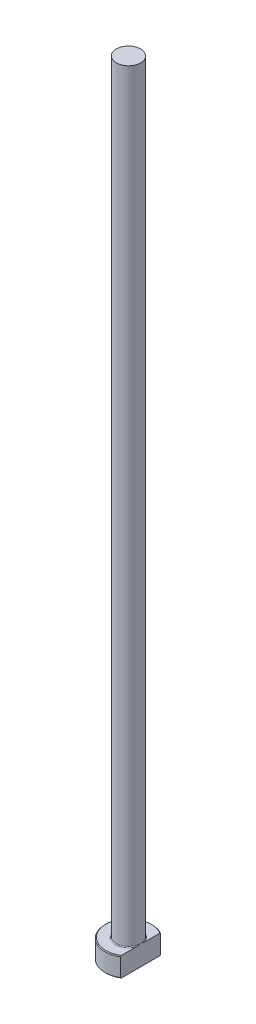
ISO-10303-21;
HEADER;
FILE_DESCRIPTION(('STEP AP214'),'2;1');
FILE_NAME('part.step','',(''),(''),'','','');
FILE_SCHEMA(('AUTOMOTIVE_DESIGN { 1 0 10303 214 1 1 1 1 }'));
ENDSEC;
DATA;
#1=APPLICATION_CONTEXT('core data for automotive mechanical design processes');
#2=APPLICATION_PROTOCOL_DEFINITION('international standard','automotive_design',2000,#1);
#3=PRODUCT_CONTEXT('',#1,'mechanical');
#4=PRODUCT('Part','Part','',(#3));
#5=PRODUCT_RELATED_PRODUCT_CATEGORY('part','',(#4));
#6=PRODUCT_DEFINITION_FORMATION('','',#4);
#7=PRODUCT_DEFINITION_CONTEXT('part definition',#1,'design');
#8=PRODUCT_DEFINITION('design','',#6,#7);
#9=PRODUCT_DEFINITION_SHAPE('','',#8);
#10=(LENGTH_UNIT() NAMED_UNIT(*) SI_UNIT(.MILLI.,.METRE.));
#11=(NAMED_UNIT(*) PLANE_ANGLE_UNIT() SI_UNIT($,.RADIAN.));
#12=(NAMED_UNIT(*) SI_UNIT($,.STERADIAN.) SOLID_ANGLE_UNIT());
#13=UNCERTAINTY_MEASURE_WITH_UNIT(LENGTH_MEASURE(1.E-05),#10,'distance_accuracy_value','');
#14=(GEOMETRIC_REPRESENTATION_CONTEXT(3) GLOBAL_UNCERTAINTY_ASSIGNED_CONTEXT((#13)) GLOBAL_UNIT_ASSIGNED_CONTEXT((#10,
#11,#12)) REPRESENTATION_CONTEXT('',''));
#15=CARTESIAN_POINT('',(0.,0.,0.));
#16=DIRECTION('',(0.,0.,1.));
#17=DIRECTION('',(1.,0.,0.));
#18=AXIS2_PLACEMENT_3D('',#15,#16,#17);
#19=CARTESIAN_POINT('',(0.,0.,0.));
#20=DIRECTION('',(0.,-1.,0.));
#21=DIRECTION('',(0.,0.,-1.));
#22=AXIS2_PLACEMENT_3D('',#19,#20,#21);
#23=PLANE('',#22);
#24=CARTESIAN_POINT('',(0.,0.,0.));
#25=DIRECTION('',(0.,-1.,0.));
#26=DIRECTION('',(0.,0.,-1.));
#27=AXIS2_PLACEMENT_3D('',#24,#25,#26);
#28=CIRCLE('',#27,5.79999999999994);
#29=CARTESIAN_POINT('',(3.09999999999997,0.,4.90204039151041));
#30=VERTEX_POINT('',#29);
#31=CARTESIAN_POINT('',(3.09999999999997,0.,-4.90204039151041));
#32=VERTEX_POINT('',#31);
#33=EDGE_CURVE('E98',#30,#32,#28,.T.);
#34=ORIENTED_EDGE('',*,*,#33,.T.);
#35=DIRECTION('',(0.,0.,1.));
#36=VECTOR('',#35,1.);
#37=CARTESIAN_POINT('',(3.09999999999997,0.,-5.13711981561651));
#38=LINE('',#37,#36);
#39=EDGE_CURVE('E83',#32,#30,#38,.T.);
#40=ORIENTED_EDGE('',*,*,#39,.T.);
#41=EDGE_LOOP('',(#34,#40));
#42=FACE_BOUND('',#41,.T.);
#43=ADVANCED_FACE('F32',(#42),#23,.T.);
#44=CARTESIAN_POINT('',(0.,259.958771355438,0.));
#45=DIRECTION('',(0.,1.,0.));
#46=DIRECTION('',(0.,0.,1.));
#47=AXIS2_PLACEMENT_3D('',#44,#45,#46);
#48=CYLINDRICAL_SURFACE('',#47,5.99999999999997);
#49=CARTESIAN_POINT('',(0.,4.80000000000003,0.));
#50=DIRECTION('',(0.,1.,0.));
#51=DIRECTION('',(0.,0.,1.));
#52=AXIS2_PLACEMENT_3D('',#49,#50,#51);
#53=CIRCLE('',#52,5.99999999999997);
#54=CARTESIAN_POINT('',(3.09999999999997,4.80000000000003,5.13711981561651));
#55=VERTEX_POINT('',#54);
#56=CARTESIAN_POINT('',(3.09999999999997,4.80000000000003,-5.13711981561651));
#57=VERTEX_POINT('',#56);
#58=EDGE_CURVE('E104',#55,#57,#53,.F.);
#59=ORIENTED_EDGE('',*,*,#58,.T.);
#60=DIRECTION('',(0.,-1.,0.));
#61=VECTOR('',#60,1.);
#62=CARTESIAN_POINT('',(3.09999999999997,200.,-5.13711981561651));
#63=LINE('',#62,#61);
#64=CARTESIAN_POINT('',(3.09999999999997,0.200000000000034,-5.13711981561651));
#65=VERTEX_POINT('',#64);
#66=EDGE_CURVE('E183',#57,#65,#63,.T.);
#67=ORIENTED_EDGE('',*,*,#66,.T.);
#68=CARTESIAN_POINT('',(0.,0.200000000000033,0.));
#69=DIRECTION('',(0.,-1.,0.));
#70=DIRECTION('',(0.,0.,-1.));
#71=AXIS2_PLACEMENT_3D('',#68,#69,#70);
#72=CIRCLE('',#71,5.99999999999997);
#73=CARTESIAN_POINT('',(3.09999999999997,0.200000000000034,5.13711981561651));
#74=VERTEX_POINT('',#73);
#75=EDGE_CURVE('E100',#65,#74,#72,.F.);
#76=ORIENTED_EDGE('',*,*,#75,.T.);
#77=DIRECTION('',(0.,-1.,0.));
#78=VECTOR('',#77,1.);
#79=CARTESIAN_POINT('',(3.09999999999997,200.,5.13711981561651));
#80=LINE('',#79,#78);
#81=EDGE_CURVE('E93',#55,#74,#80,.T.);
#82=ORIENTED_EDGE('',*,*,#81,.F.);
#83=EDGE_LOOP('',(#59,#67,#76,#82));
#84=FACE_BOUND('',#83,.T.);
#85=ADVANCED_FACE('F158',(#84),#48,.T.);
#86=CARTESIAN_POINT('',(-5.99999999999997,5.,0.));
#87=DIRECTION('',(0.,1.,0.));
#88=DIRECTION('',(0.,0.,1.));
#89=AXIS2_PLACEMENT_3D('',#86,#87,#88);
#90=PLANE('',#89);
#91=CARTESIAN_POINT('',(0.,5.,0.));
#92=DIRECTION('',(0.,1.,0.));
#93=DIRECTION('',(0.,0.,1.));
#94=AXIS2_PLACEMENT_3D('',#91,#92,#93);
#95=CIRCLE('',#94,5.79999999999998);
#96=CARTESIAN_POINT('',(3.09999999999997,5.,-4.90204039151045));
#97=VERTEX_POINT('',#96);
#98=CARTESIAN_POINT('',(3.09999999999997,5.,4.90204039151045));
#99=VERTEX_POINT('',#98);
#100=EDGE_CURVE('E178',#97,#99,#95,.T.);
#101=ORIENTED_EDGE('',*,*,#100,.T.);
#102=DIRECTION('',(0.,0.,-1.));
#103=VECTOR('',#102,1.);
#104=CARTESIAN_POINT('',(3.09999999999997,5.,0.));
#105=LINE('',#104,#103);
#106=CARTESIAN_POINT('',(3.09999999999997,4.99999999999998,1.13137084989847));
#107=VERTEX_POINT('',#106);
#108=EDGE_CURVE('E57',#99,#107,#105,.T.);
#109=ORIENTED_EDGE('',*,*,#108,.T.);
#110=CARTESIAN_POINT('',(0.,5.,0.));
#111=DIRECTION('',(0.,1.,0.));
#112=DIRECTION('',(0.,0.,1.));
#113=AXIS2_PLACEMENT_3D('',#110,#111,#112);
#114=CIRCLE('',#113,3.29999999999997);
#115=CARTESIAN_POINT('',(3.09999999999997,4.99999999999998,-1.13137084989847));
#116=VERTEX_POINT('',#115);
#117=EDGE_CURVE('E107',#107,#116,#114,.F.);
#118=ORIENTED_EDGE('',*,*,#117,.T.);
#119=EDGE_CURVE('E136',#116,#97,#105,.T.);
#120=ORIENTED_EDGE('',*,*,#119,.T.);
#121=EDGE_LOOP('',(#101,#109,#118,#120));
#122=FACE_BOUND('',#121,.T.);
#123=ADVANCED_FACE('F147',(#122),#90,.T.);
#124=CARTESIAN_POINT('',(0.,5.,0.));
#125=DIRECTION('',(0.,-1.,0.));
#126=DIRECTION('',(0.,0.,-1.));
#127=AXIS2_PLACEMENT_3D('',#124,#125,#126);
#128=CONICAL_SURFACE('',#127,5.79999999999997,0.785398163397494);
#129=ORIENTED_EDGE('',*,*,#58,.F.);
#130=CARTESIAN_POINT('',(3.09999999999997,-0.920431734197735,11.3030314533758));
#131=CARTESIAN_POINT('',(3.09999999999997,-0.688619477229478,11.0626468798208));
#132=CARTESIAN_POINT('',(3.09999999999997,-0.457063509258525,10.8220144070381));
#133=CARTESIAN_POINT('',(3.09999999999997,0.00539791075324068,10.3401205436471));
#134=CARTESIAN_POINT('',(3.09999999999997,0.236303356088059,10.0988591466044));
#135=CARTESIAN_POINT('',(3.09999999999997,0.69741098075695,9.61548494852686));
#136=CARTESIAN_POINT('',(3.09999999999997,0.927612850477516,9.3733718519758));
#137=CARTESIAN_POINT('',(3.09999999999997,1.38702344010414,8.88820676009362));
#138=CARTESIAN_POINT('',(3.09999999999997,1.61623216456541,8.64515476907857));
#139=CARTESIAN_POINT('',(3.09999999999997,2.06943803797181,8.16208218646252));
#140=CARTESIAN_POINT('',(3.09999999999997,2.29345676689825,7.92208185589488));
#141=CARTESIAN_POINT('',(3.09999999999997,2.73992554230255,7.4406269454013));
#142=CARTESIAN_POINT('',(3.09999999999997,2.96237559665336,7.19917237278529));
#143=CARTESIAN_POINT('',(3.09999999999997,3.40516728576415,6.71440911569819));
#144=CARTESIAN_POINT('',(3.09999999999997,3.6255092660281,6.47110074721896));
#145=CARTESIAN_POINT('',(3.09999999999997,4.06338097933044,5.98197014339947));
#146=CARTESIAN_POINT('',(3.09999999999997,4.28091078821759,5.736147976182));
#147=CARTESIAN_POINT('',(3.09999999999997,4.64723250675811,5.31542741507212));
#148=CARTESIAN_POINT('',(3.09999999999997,4.79703819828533,5.14141294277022));
#149=CARTESIAN_POINT('',(3.09999999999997,5.09412273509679,4.7912056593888));
#150=CARTESIAN_POINT('',(3.09999999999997,5.24140133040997,4.61501263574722));
#151=CARTESIAN_POINT('',(3.09999999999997,5.5340047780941,4.25808346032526));
#152=CARTESIAN_POINT('',(3.09999999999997,5.67929603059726,4.07731963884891));
#153=CARTESIAN_POINT('',(3.09999999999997,5.96506147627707,3.71208453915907));
#154=CARTESIAN_POINT('',(3.09999999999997,6.10553688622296,3.52761421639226));
#155=CARTESIAN_POINT('',(3.09999999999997,6.38162972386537,3.15098880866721));
#156=CARTESIAN_POINT('',(3.09999999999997,6.5171507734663,2.95876205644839));
#157=CARTESIAN_POINT('',(3.09999999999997,6.71260042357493,2.66498269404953));
#158=CARTESIAN_POINT('',(3.09999999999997,6.77649142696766,2.56607098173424));
#159=CARTESIAN_POINT('',(3.09999999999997,6.90093996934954,2.36617934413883));
#160=CARTESIAN_POINT('',(3.09999999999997,6.96149785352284,2.26519963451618));
#161=CARTESIAN_POINT('',(3.09999999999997,7.07778312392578,2.06197879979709));
#162=CARTESIAN_POINT('',(3.09999999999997,7.13355741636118,1.9597648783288));
#163=CARTESIAN_POINT('',(3.09999999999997,7.23993773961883,1.75269687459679));
#164=CARTESIAN_POINT('',(3.09999999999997,7.29054278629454,1.64784229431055));
#165=CARTESIAN_POINT('',(3.09999999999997,7.43232844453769,1.329374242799));
#166=CARTESIAN_POINT('',(3.09999999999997,7.51393038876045,1.11110705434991));
#167=CARTESIAN_POINT('',(3.09999999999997,7.60389052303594,0.78418122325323));
#168=CARTESIAN_POINT('',(3.09999999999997,7.62802295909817,0.679829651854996));
#169=CARTESIAN_POINT('',(3.09999999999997,7.66638713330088,0.46928482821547));
#170=CARTESIAN_POINT('',(3.09999999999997,7.68061997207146,0.363091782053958));
#171=CARTESIAN_POINT('',(3.09999999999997,7.69816738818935,0.150218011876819));
#172=CARTESIAN_POINT('',(3.09999999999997,7.70152516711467,0.0435409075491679));
#173=CARTESIAN_POINT('',(3.09999999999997,7.69719360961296,-0.169591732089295));
#174=CARTESIAN_POINT('',(3.09999999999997,7.68950359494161,-0.276047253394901));
#175=CARTESIAN_POINT('',(3.09999999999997,7.66373252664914,-0.486880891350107));
#176=CARTESIAN_POINT('',(3.09999999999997,7.64572733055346,-0.591268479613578));
#177=CARTESIAN_POINT('',(3.09999999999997,7.60052536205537,-0.798013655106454));
#178=CARTESIAN_POINT('',(3.09999999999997,7.57332729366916,-0.900370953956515));
#179=CARTESIAN_POINT('',(3.09999999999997,7.51094394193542,-1.10330613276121));
#180=CARTESIAN_POINT('',(3.09999999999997,7.47570859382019,-1.20386840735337));
#181=CARTESIAN_POINT('',(3.09999999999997,7.39875968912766,-1.40242722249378));
#182=CARTESIAN_POINT('',(3.09999999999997,7.35704736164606,-1.50042424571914));
#183=CARTESIAN_POINT('',(3.09999999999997,7.22811120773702,-1.78198575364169));
#184=CARTESIAN_POINT('',(3.09999999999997,7.13397777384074,-1.96237556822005));
#185=CARTESIAN_POINT('',(3.09999999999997,6.93309444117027,-2.31605883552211));
#186=CARTESIAN_POINT('',(3.09999999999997,6.82632930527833,-2.48934337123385));
#187=CARTESIAN_POINT('',(3.09999999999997,6.60386158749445,-2.83097436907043));
#188=CARTESIAN_POINT('',(3.09999999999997,6.48812633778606,-2.99929937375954));
#189=CARTESIAN_POINT('',(3.09999999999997,6.2507350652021,-3.33155975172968));
#190=CARTESIAN_POINT('',(3.09999999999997,6.12908188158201,-3.49549717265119));
#191=CARTESIAN_POINT('',(3.09999999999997,5.87989164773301,-3.82213838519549));
#192=CARTESIAN_POINT('',(3.09999999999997,5.75229938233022,-3.98479985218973));
#193=CARTESIAN_POINT('',(3.09999999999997,5.49383773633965,-4.30751445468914));
#194=CARTESIAN_POINT('',(3.09999999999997,5.36296802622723,-4.46756732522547));
#195=CARTESIAN_POINT('',(3.09999999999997,5.09906242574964,-4.78523580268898));
#196=CARTESIAN_POINT('',(3.09999999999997,4.96603235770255,-4.94285625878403));
#197=CARTESIAN_POINT('',(3.09999999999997,4.69805373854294,-5.25645943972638));
#198=CARTESIAN_POINT('',(3.09999999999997,4.56310515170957,-5.41244213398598));
#199=CARTESIAN_POINT('',(3.09999999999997,4.2080943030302,-5.81877937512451));
#200=CARTESIAN_POINT('',(3.09999999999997,3.98681570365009,-6.06807041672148));
#201=CARTESIAN_POINT('',(3.09999999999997,3.54147161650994,-6.56415415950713));
#202=CARTESIAN_POINT('',(3.09999999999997,3.31740605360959,-6.8109467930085));
#203=CARTESIAN_POINT('',(3.09999999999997,2.86701901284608,-7.30287446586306));
#204=CARTESIAN_POINT('',(3.09999999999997,2.64069567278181,-7.54800779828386));
#205=CARTESIAN_POINT('',(3.09999999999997,2.18649425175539,-8.0368296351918));
#206=CARTESIAN_POINT('',(3.09999999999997,1.95861616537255,-8.28051813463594));
#207=CARTESIAN_POINT('',(3.09999999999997,1.5108345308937,-8.75699429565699));
#208=CARTESIAN_POINT('',(3.09999999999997,1.29097841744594,-8.98982656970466));
#209=CARTESIAN_POINT('',(3.09999999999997,0.850379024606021,-9.4546514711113));
#210=CARTESIAN_POINT('',(3.09999999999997,0.629635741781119,-9.68664409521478));
#211=CARTESIAN_POINT('',(3.09999999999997,0.187673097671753,-10.1496925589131));
#212=CARTESIAN_POINT('',(3.09999999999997,-0.0335454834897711,-10.3807491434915));
#213=CARTESIAN_POINT('',(3.09999999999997,-0.476574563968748,-10.8422904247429));
#214=CARTESIAN_POINT('',(3.09999999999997,-0.698385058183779,-11.0727751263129));
#215=CARTESIAN_POINT('',(3.09999999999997,-0.920431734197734,-11.3030314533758));
#216=B_SPLINE_CURVE_WITH_KNOTS('',3,(#130,#131,#132,#133,#134,#135,#136,#137,#138,#139,#140,
#141,#142,#143,#144,#145,#146,#147,#148,#149,#150,#151,#152,#153,#154,#155,#156,#157,#158,#159,
#160,#161,#162,#163,#164,#165,#166,#167,#168,#169,#170,#171,#172,#173,#174,#175,#176,#177,#178,
#179,#180,#181,#182,#183,#184,#185,#186,#187,#188,#189,#190,#191,#192,#193,#194,#195,#196,#197,
#198,#199,#200,#201,#202,#203,#204,#205,#206,#207,#208,#209,#210,#211,#212,#213,#214,#215),
.UNSPECIFIED.,.F.,.F.,(4,2,2,2,2,2,2,2,2,2,2,2,2,2,2,2,2,2,2,2,2,2,2,2,2,2,2,2,2,2,2,2,2,2,2,2,
2,2,2,2,2,2,4),(0.,1.00184641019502,2.00370311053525,3.00595078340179,4.00819385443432,
4.9931053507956,5.97801190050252,6.9627541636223,7.94746981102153,8.6362949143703,
9.32518776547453,10.0208755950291,10.7163863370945,11.421700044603,11.7749044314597,
12.1280721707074,12.4772435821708,12.8264813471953,13.5223439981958,13.8432758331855,
14.1641719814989,14.4837917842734,14.8034312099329,15.1207496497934,15.4381128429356,
15.7575096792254,16.0768459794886,16.6863983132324,17.296693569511,17.9093265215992,
18.5216683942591,19.1418114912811,19.7620171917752,20.3807633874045,20.9995211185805,
21.9994842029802,22.9994743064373,24.0003716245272,25.0012724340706,25.961961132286,
26.9226535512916,27.882299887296,28.8419379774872),.UNSPECIFIED.);
#217=EDGE_CURVE('E135',#55,#99,#216,.T.);
#218=ORIENTED_EDGE('',*,*,#217,.T.);
#219=ORIENTED_EDGE('',*,*,#100,.F.);
#220=EDGE_CURVE('E127',#97,#57,#216,.T.);
#221=ORIENTED_EDGE('',*,*,#220,.T.);
#222=EDGE_LOOP('',(#129,#218,#219,#221));
#223=FACE_BOUND('',#222,.T.);
#224=ADVANCED_FACE('F143',(#223),#128,.T.);
#225=CARTESIAN_POINT('',(0.,0.200000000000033,0.));
#226=DIRECTION('',(0.,1.,0.));
#227=DIRECTION('',(0.,0.,1.));
#228=AXIS2_PLACEMENT_3D('',#225,#226,#227);
#229=CONICAL_SURFACE('',#228,5.99999999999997,0.785398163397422);
#230=ORIENTED_EDGE('',*,*,#75,.F.);
#231=CARTESIAN_POINT('',(3.09999999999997,5.92043173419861,-11.3030314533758));
#232=CARTESIAN_POINT('',(3.09999999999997,5.68861947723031,-11.0626468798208));
#233=CARTESIAN_POINT('',(3.09999999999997,5.4570635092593,-10.822014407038));
#234=CARTESIAN_POINT('',(3.09999999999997,4.99460208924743,-10.340120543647));
#235=CARTESIAN_POINT('',(3.09999999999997,4.76369664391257,-10.0988591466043));
#236=CARTESIAN_POINT('',(3.09999999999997,4.30258901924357,-9.61548494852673));
#237=CARTESIAN_POINT('',(3.09999999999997,4.07238714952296,-9.37337185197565));
#238=CARTESIAN_POINT('',(3.09999999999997,3.61297655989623,-8.88820676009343));
#239=CARTESIAN_POINT('',(3.09999999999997,3.38376783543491,-8.64515476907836));
#240=CARTESIAN_POINT('',(3.09999999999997,2.93056196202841,-8.16208218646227));
#241=CARTESIAN_POINT('',(3.09999999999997,2.70654323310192,-7.92208185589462));
#242=CARTESIAN_POINT('',(3.09999999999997,2.26007445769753,-7.44062694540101));
#243=CARTESIAN_POINT('',(3.09999999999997,2.03762440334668,-7.19917237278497));
#244=CARTESIAN_POINT('',(3.09999999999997,1.59483271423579,-6.71440911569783));
#245=CARTESIAN_POINT('',(3.09999999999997,1.3744907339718,-6.47110074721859));
#246=CARTESIAN_POINT('',(3.09999999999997,0.936619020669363,-5.98197014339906));
#247=CARTESIAN_POINT('',(3.09999999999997,0.71908921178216,-5.73614797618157));
#248=CARTESIAN_POINT('',(3.09999999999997,0.352767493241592,-5.31542741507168));
#249=CARTESIAN_POINT('',(3.09999999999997,0.202961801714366,-5.1414129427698));
#250=CARTESIAN_POINT('',(3.09999999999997,-0.094122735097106,-4.7912056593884));
#251=CARTESIAN_POINT('',(3.09999999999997,-0.241401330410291,-4.61501263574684));
#252=CARTESIAN_POINT('',(3.09999999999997,-0.534004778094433,-4.25808346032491));
#253=CARTESIAN_POINT('',(3.09999999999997,-0.679296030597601,-4.07731963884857));
#254=CARTESIAN_POINT('',(3.09999999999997,-0.965061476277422,-3.71208453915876));
#255=CARTESIAN_POINT('',(3.09999999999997,-1.10553688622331,-3.52761421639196));
#256=CARTESIAN_POINT('',(3.09999999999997,-1.38162972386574,-3.15098880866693));
#257=CARTESIAN_POINT('',(3.09999999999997,-1.51715077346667,-2.95876205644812));
#258=CARTESIAN_POINT('',(3.09999999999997,-1.71260042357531,-2.66498269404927));
#259=CARTESIAN_POINT('',(3.09999999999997,-1.77649142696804,-2.56607098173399));
#260=CARTESIAN_POINT('',(3.09999999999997,-1.90093996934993,-2.36617934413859));
#261=CARTESIAN_POINT('',(3.09999999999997,-1.96149785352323,-2.26519963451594));
#262=CARTESIAN_POINT('',(3.09999999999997,-2.07778312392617,-2.06197879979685));
#263=CARTESIAN_POINT('',(3.09999999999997,-2.13355741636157,-1.95976487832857));
#264=CARTESIAN_POINT('',(3.09999999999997,-2.23993773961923,-1.75269687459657));
#265=CARTESIAN_POINT('',(3.09999999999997,-2.29054278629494,-1.64784229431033));
#266=CARTESIAN_POINT('',(3.09999999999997,-2.43232844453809,-1.3293742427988));
#267=CARTESIAN_POINT('',(3.09999999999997,-2.51393038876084,-1.11110705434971));
#268=CARTESIAN_POINT('',(3.09999999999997,-2.60389052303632,-0.784181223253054));
#269=CARTESIAN_POINT('',(3.09999999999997,-2.62802295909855,-0.679829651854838));
#270=CARTESIAN_POINT('',(3.09999999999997,-2.66638713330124,-0.46928482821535));
#271=CARTESIAN_POINT('',(3.09999999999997,-2.68061997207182,-0.363091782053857));
#272=CARTESIAN_POINT('',(3.09999999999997,-2.69816738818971,-0.150218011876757));
#273=CARTESIAN_POINT('',(3.09999999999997,-2.70152516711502,-0.0435409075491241));
#274=CARTESIAN_POINT('',(3.09999999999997,-2.69719360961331,0.1695917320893));
#275=CARTESIAN_POINT('',(3.09999999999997,-2.68950359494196,0.276047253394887));
#276=CARTESIAN_POINT('',(3.09999999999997,-2.6637325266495,0.486880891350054));
#277=CARTESIAN_POINT('',(3.09999999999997,-2.64572733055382,0.591268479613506));
#278=CARTESIAN_POINT('',(3.09999999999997,-2.60052536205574,0.798013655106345));
#279=CARTESIAN_POINT('',(3.09999999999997,-2.57332729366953,0.900370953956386));
#280=CARTESIAN_POINT('',(3.09999999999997,-2.51094394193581,1.10330613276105));
#281=CARTESIAN_POINT('',(3.09999999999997,-2.47570859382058,1.20386840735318));
#282=CARTESIAN_POINT('',(3.09999999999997,-2.39875968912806,1.40242722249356));
#283=CARTESIAN_POINT('',(3.09999999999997,-2.35704736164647,1.5004242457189));
#284=CARTESIAN_POINT('',(3.09999999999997,-2.22811120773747,1.78198575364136));
#285=CARTESIAN_POINT('',(3.09999999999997,-2.13397777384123,1.96237556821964));
#286=CARTESIAN_POINT('',(3.09999999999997,-1.93309444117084,2.31605883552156));
#287=CARTESIAN_POINT('',(3.09999999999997,-1.82632930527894,2.48934337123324));
#288=CARTESIAN_POINT('',(3.09999999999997,-1.60386158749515,2.83097436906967));
#289=CARTESIAN_POINT('',(3.09999999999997,-1.48812633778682,2.99929937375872));
#290=CARTESIAN_POINT('',(3.09999999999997,-1.25073506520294,3.33155975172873));
#291=CARTESIAN_POINT('',(3.09999999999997,-1.1290818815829,3.49549717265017));
#292=CARTESIAN_POINT('',(3.09999999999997,-0.879891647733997,3.82213838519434));
#293=CARTESIAN_POINT('',(3.09999999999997,-0.752299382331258,3.98479985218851));
#294=CARTESIAN_POINT('',(3.09999999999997,-0.493837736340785,4.30751445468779));
#295=CARTESIAN_POINT('',(3.09999999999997,-0.362968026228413,4.46756732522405));
#296=CARTESIAN_POINT('',(3.09999999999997,-0.0990624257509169,4.78523580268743));
#297=CARTESIAN_POINT('',(3.09999999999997,0.033967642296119,4.94285625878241));
#298=CARTESIAN_POINT('',(3.09999999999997,0.301946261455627,5.25645943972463));
#299=CARTESIAN_POINT('',(3.09999999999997,0.436894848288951,5.41244213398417));
#300=CARTESIAN_POINT('',(3.09999999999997,0.791905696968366,5.81877937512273));
#301=CARTESIAN_POINT('',(3.09999999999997,1.01318429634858,6.06807041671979));
#302=CARTESIAN_POINT('',(3.09999999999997,1.45852838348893,6.56415415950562));
#303=CARTESIAN_POINT('',(3.09999999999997,1.68259394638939,6.81094679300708));
#304=CARTESIAN_POINT('',(3.09999999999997,2.13298098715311,7.30287446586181));
#305=CARTESIAN_POINT('',(3.09999999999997,2.35930432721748,7.54800779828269));
#306=CARTESIAN_POINT('',(3.09999999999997,2.81350574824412,8.03682963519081));
#307=CARTESIAN_POINT('',(3.09999999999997,3.04138383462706,8.28051813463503));
#308=CARTESIAN_POINT('',(3.09999999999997,3.48916546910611,8.75699429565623));
#309=CARTESIAN_POINT('',(3.09999999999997,3.70902158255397,8.98982656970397));
#310=CARTESIAN_POINT('',(3.09999999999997,4.14962097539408,9.45465147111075));
#311=CARTESIAN_POINT('',(3.09999999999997,4.37036425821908,9.6866440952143));
#312=CARTESIAN_POINT('',(3.09999999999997,4.81232690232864,10.1496925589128));
#313=CARTESIAN_POINT('',(3.09999999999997,5.03354548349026,10.3807491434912));
#314=CARTESIAN_POINT('',(3.09999999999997,5.47657456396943,10.8422904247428));
#315=CARTESIAN_POINT('',(3.09999999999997,5.69838505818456,11.0727751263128));
#316=CARTESIAN_POINT('',(3.09999999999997,5.92043173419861,11.3030314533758));
#317=B_SPLINE_CURVE_WITH_KNOTS('',3,(#231,#232,#233,#234,#235,#236,#237,#238,#239,#240,#241,
#242,#243,#244,#245,#246,#247,#248,#249,#250,#251,#252,#253,#254,#255,#256,#257,#258,#259,#260,
#261,#262,#263,#264,#265,#266,#267,#268,#269,#270,#271,#272,#273,#274,#275,#276,#277,#278,#279,
#280,#281,#282,#283,#284,#285,#286,#287,#288,#289,#290,#291,#292,#293,#294,#295,#296,#297,#298,
#299,#300,#301,#302,#303,#304,#305,#306,#307,#308,#309,#310,#311,#312,#313,#314,#315,#316),
.UNSPECIFIED.,.F.,.F.,(4,2,2,2,2,2,2,2,2,2,2,2,2,2,2,2,2,2,2,2,2,2,2,2,2,2,2,2,2,2,2,2,2,2,2,2,
2,2,2,2,2,2,4),(0.,1.00184641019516,2.00370311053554,3.00595078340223,4.00819385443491,
4.99310535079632,5.97801190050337,6.96275416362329,7.94746981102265,8.6362949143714,
9.32518776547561,10.0208755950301,10.7163863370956,11.421700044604,11.7749044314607,
12.1280721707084,12.4772435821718,12.8264813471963,13.5223439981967,13.8432758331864,
14.1641719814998,14.4837917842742,14.8034312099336,15.1207496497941,15.4381128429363,
15.757509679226,16.0768459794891,16.6863983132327,17.2966935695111,17.909326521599,
18.5216683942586,19.1418114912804,19.7620171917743,20.3807633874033,20.999521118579,
21.9994842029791,22.9994743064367,24.000371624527,25.0012724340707,25.9619611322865,
26.9226535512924,27.8822998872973,28.8419379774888),.UNSPECIFIED.);
#318=EDGE_CURVE('E86',#65,#32,#317,.T.);
#319=ORIENTED_EDGE('',*,*,#318,.T.);
#320=ORIENTED_EDGE('',*,*,#33,.F.);
#321=EDGE_CURVE('E89',#30,#74,#317,.T.);
#322=ORIENTED_EDGE('',*,*,#321,.T.);
#323=EDGE_LOOP('',(#230,#319,#320,#322));
#324=FACE_BOUND('',#323,.T.);
#325=ADVANCED_FACE('F97',(#324),#229,.T.);
#326=CARTESIAN_POINT('',(0.,5.19999999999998,0.));
#327=DIRECTION('',(0.,1.,0.));
#328=DIRECTION('',(0.,0.,1.));
#329=AXIS2_PLACEMENT_3D('',#326,#327,#328);
#330=TOROIDAL_SURFACE('',#329,3.29999999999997,0.2);
#331=CARTESIAN_POINT('',(3.09999999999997,5.19999999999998,0.));
#332=CARTESIAN_POINT('',(3.09999999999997,5.20000050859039,8.63470448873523E-11));
#333=CARTESIAN_POINT('',(3.09999999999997,5.20000101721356,-1.96831350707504E-07));
#334=CARTESIAN_POINT('',(3.09999999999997,5.20000196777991,-7.43387548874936E-07));
#335=CARTESIAN_POINT('',(3.09999999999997,5.20000239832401,-1.10608751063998E-06));
#336=CARTESIAN_POINT('',(3.09999999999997,5.20000329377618,-1.97482885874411E-06));
#337=CARTESIAN_POINT('',(3.09999999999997,5.20000374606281,-2.49491365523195E-06));
#338=CARTESIAN_POINT('',(3.09999999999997,5.20000455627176,-3.57320004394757E-06));
#339=CARTESIAN_POINT('',(3.09999999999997,5.20000491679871,-4.12959627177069E-06));
#340=CARTESIAN_POINT('',(3.09999999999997,5.20000625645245,-6.28443543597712E-06));
#341=CARTESIAN_POINT('',(3.09999999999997,5.20000716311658,-7.93057681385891E-06));
#342=CARTESIAN_POINT('',(3.09999999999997,5.20000865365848,-1.11908861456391E-05));
#343=CARTESIAN_POINT('',(3.09999999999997,5.20000925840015,-1.27959111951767E-05));
#344=CARTESIAN_POINT('',(3.09999999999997,5.20001179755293,-1.95895744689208E-05));
#345=CARTESIAN_POINT('',(3.09999999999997,5.20001369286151,-2.47960258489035E-05));
#346=CARTESIAN_POINT('',(3.09999999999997,5.20001648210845,-3.46313916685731E-05));
#347=CARTESIAN_POINT('',(3.09999999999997,5.20001748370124,-3.9229578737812E-05));
#348=CARTESIAN_POINT('',(3.09999999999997,5.20002478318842,-7.34062169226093E-05));
#349=CARTESIAN_POINT('',(3.09999999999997,5.20003031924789,-0.000103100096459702));
#350=CARTESIAN_POINT('',(3.09999999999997,5.20005455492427,-0.000220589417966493));
#351=CARTESIAN_POINT('',(3.09999999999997,5.2000776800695,-0.000307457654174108));
#352=CARTESIAN_POINT('',(3.09999999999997,5.20016786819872,-0.000651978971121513));
#353=CARTESIAN_POINT('',(3.09999999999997,5.20023206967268,-0.000910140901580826));
#354=CARTESIAN_POINT('',(3.09999999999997,5.2004894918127,-0.00193760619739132));
#355=CARTESIAN_POINT('',(3.09999999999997,5.20068632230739,-0.00270624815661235));
#356=CARTESIAN_POINT('',(3.09999999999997,5.20150547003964,-0.00591366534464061));
#357=CARTESIAN_POINT('',(3.09999999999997,5.20212323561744,-0.00835327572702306));
#358=CARTESIAN_POINT('',(3.09999999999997,5.2072994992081,-0.0287840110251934));
#359=CARTESIAN_POINT('',(3.09999999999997,5.21187465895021,-0.046772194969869));
#360=CARTESIAN_POINT('',(3.09999999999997,5.22081406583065,-0.0820386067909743));
#361=CARTESIAN_POINT('',(3.09999999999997,5.22517945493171,-0.0993165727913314));
#362=CARTESIAN_POINT('',(3.09999999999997,5.23938711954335,-0.155760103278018));
#363=CARTESIAN_POINT('',(3.09999999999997,5.24916620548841,-0.19494192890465));
#364=CARTESIAN_POINT('',(3.09999999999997,5.26559812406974,-0.262010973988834));
#365=CARTESIAN_POINT('',(3.09999999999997,5.27233495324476,-0.289877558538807));
#366=CARTESIAN_POINT('',(3.09999999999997,5.28539894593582,-0.344925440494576));
#367=CARTESIAN_POINT('',(3.09999999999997,5.2917322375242,-0.372105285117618));
#368=CARTESIAN_POINT('',(3.09999999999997,5.3104657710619,-0.454441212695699));
#369=CARTESIAN_POINT('',(3.09999999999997,5.32242624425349,-0.509699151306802));
#370=CARTESIAN_POINT('',(3.09999999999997,5.34470875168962,-0.621095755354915));
#371=CARTESIAN_POINT('',(3.09999999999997,5.35501420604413,-0.677237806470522));
#372=CARTESIAN_POINT('',(3.09999999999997,5.37397233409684,-0.795308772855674));
#373=CARTESIAN_POINT('',(3.09999999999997,5.38237372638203,-0.857279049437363));
#374=CARTESIAN_POINT('',(3.09999999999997,5.39483964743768,-0.981488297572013));
#375=CARTESIAN_POINT('',(3.09999999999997,5.39891956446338,-1.04372551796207));
#376=CARTESIAN_POINT('',(3.09999999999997,5.4002522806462,-1.1364625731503));
#377=CARTESIAN_POINT('',(3.09999999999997,5.39992868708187,-1.16692514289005));
#378=CARTESIAN_POINT('',(3.09999999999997,5.39736890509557,-1.22783403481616));
#379=CARTESIAN_POINT('',(3.09999999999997,5.39512949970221,-1.25828024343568));
#380=CARTESIAN_POINT('',(3.09999999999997,5.3882758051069,-1.31816284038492));
#381=CARTESIAN_POINT('',(3.09999999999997,5.38372059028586,-1.34760578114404));
#382=CARTESIAN_POINT('',(3.09999999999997,5.37149785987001,-1.40581436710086));
#383=CARTESIAN_POINT('',(3.09999999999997,5.36383981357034,-1.43458179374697));
#384=CARTESIAN_POINT('',(3.09999999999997,5.34913051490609,-1.47610977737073));
#385=CARTESIAN_POINT('',(3.09999999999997,5.34380195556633,-1.48947638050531));
#386=CARTESIAN_POINT('',(3.09999999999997,5.33179609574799,-1.51565425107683));
#387=CARTESIAN_POINT('',(3.09999999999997,5.32511527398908,-1.52846396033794));
#388=CARTESIAN_POINT('',(3.09999999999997,5.31156812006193,-1.55058530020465));
#389=CARTESIAN_POINT('',(3.09999999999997,5.30500876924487,-1.56008264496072));
#390=CARTESIAN_POINT('',(3.09999999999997,5.29056237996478,-1.5780097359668));
#391=CARTESIAN_POINT('',(3.09999999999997,5.28267975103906,-1.58644287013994));
#392=CARTESIAN_POINT('',(3.09999999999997,5.26899499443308,-1.59836257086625));
#393=CARTESIAN_POINT('',(3.09999999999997,5.26370979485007,-1.60243897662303));
#394=CARTESIAN_POINT('',(3.09999999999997,5.25259769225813,-1.60977856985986));
#395=CARTESIAN_POINT('',(3.09999999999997,5.24677147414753,-1.61304276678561));
#396=CARTESIAN_POINT('',(3.09999999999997,5.23558966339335,-1.61807105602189));
#397=CARTESIAN_POINT('',(3.09999999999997,5.23030479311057,-1.61999055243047));
#398=CARTESIAN_POINT('',(3.09999999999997,5.21948724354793,-1.62291762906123));
#399=CARTESIAN_POINT('',(3.09999999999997,5.21395478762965,-1.62392601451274));
#400=CARTESIAN_POINT('',(3.09999999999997,5.20277366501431,-1.62493544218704));
#401=CARTESIAN_POINT('',(3.09999999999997,5.19712461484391,-1.62493233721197));
#402=CARTESIAN_POINT('',(3.09999999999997,5.18591949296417,-1.62390846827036));
#403=CARTESIAN_POINT('',(3.09999999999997,5.1803634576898,-1.62288731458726));
#404=CARTESIAN_POINT('',(3.09999999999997,5.16982009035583,-1.62001450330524));
#405=CARTESIAN_POINT('',(3.09999999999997,5.16481843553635,-1.61821408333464));
#406=CARTESIAN_POINT('',(3.09999999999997,5.15512149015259,-1.61392929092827));
#407=CARTESIAN_POINT('',(3.09999999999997,5.15042629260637,-1.61144471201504));
#408=CARTESIAN_POINT('',(3.09999999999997,5.13843536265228,-1.60413057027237));
#409=CARTESIAN_POINT('',(3.09999999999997,5.13143004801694,-1.59882575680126));
#410=CARTESIAN_POINT('',(3.09999999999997,5.11831643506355,-1.5871999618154));
#411=CARTESIAN_POINT('',(3.09999999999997,5.1122112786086,-1.58087557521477));
#412=CARTESIAN_POINT('',(3.09999999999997,5.09648912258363,-1.56251896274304));
#413=CARTESIAN_POINT('',(3.09999999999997,5.08770172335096,-1.54978301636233));
#414=CARTESIAN_POINT('',(3.09999999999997,5.07201622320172,-1.52323986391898));
#415=CARTESIAN_POINT('',(3.09999999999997,5.06512028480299,-1.50943145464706));
#416=CARTESIAN_POINT('',(3.09999999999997,5.05247518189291,-1.48047677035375));
#417=CARTESIAN_POINT('',(3.09999999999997,5.04680124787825,-1.46529814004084));
#418=CARTESIAN_POINT('',(3.09999999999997,5.03672275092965,-1.43451819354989));
#419=CARTESIAN_POINT('',(3.09999999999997,5.03231964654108,-1.41891641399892));
#420=CARTESIAN_POINT('',(3.09999999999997,5.02058030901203,-1.37142005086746));
#421=CARTESIAN_POINT('',(3.09999999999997,5.01483238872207,-1.3391366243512));
#422=CARTESIAN_POINT('',(3.09999999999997,5.00376797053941,-1.25503165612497));
#423=CARTESIAN_POINT('',(3.09999999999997,5.00071471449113,-1.20294070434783));
#424=CARTESIAN_POINT('',(3.09999999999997,4.99950954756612,-1.09856941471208));
#425=CARTESIAN_POINT('',(3.09999999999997,5.00137734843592,-1.04628915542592));
#426=CARTESIAN_POINT('',(3.09999999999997,5.00844280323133,-0.944923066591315));
#427=CARTESIAN_POINT('',(3.09999999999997,5.01344756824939,-0.895822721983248));
#428=CARTESIAN_POINT('',(3.09999999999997,5.02575896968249,-0.798308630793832));
#429=CARTESIAN_POINT('',(3.09999999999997,5.03304750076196,-0.749892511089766));
#430=CARTESIAN_POINT('',(3.09999999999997,5.04953811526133,-0.652335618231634));
#431=CARTESIAN_POINT('',(3.09999999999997,5.05877753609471,-0.603201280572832));
#432=CARTESIAN_POINT('',(3.09999999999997,5.07884455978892,-0.503941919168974));
#433=CARTESIAN_POINT('',(3.09999999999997,5.08970698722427,-0.453824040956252));
#434=CARTESIAN_POINT('',(3.09999999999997,5.10895219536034,-0.369008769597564));
#435=CARTESIAN_POINT('',(3.09999999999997,5.11708529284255,-0.334253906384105));
#436=CARTESIAN_POINT('',(3.09999999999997,5.13360118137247,-0.265211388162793));
#437=CARTESIAN_POINT('',(3.09999999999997,5.14198019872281,-0.230922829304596));
#438=CARTESIAN_POINT('',(3.09999999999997,5.15798158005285,-0.16629806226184));
#439=CARTESIAN_POINT('',(3.09999999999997,5.16558151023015,-0.135956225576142));
#440=CARTESIAN_POINT('',(3.09999999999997,5.1812139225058,-0.0740081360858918));
#441=CARTESIAN_POINT('',(3.09999999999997,5.18925105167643,-0.0424030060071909));
#442=CARTESIAN_POINT('',(3.09999999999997,5.19787768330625,-0.0083493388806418));
#443=CARTESIAN_POINT('',(3.09999999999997,5.1984965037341,-0.00590581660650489));
#444=CARTESIAN_POINT('',(3.09999999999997,5.19931589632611,-0.00269751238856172));
#445=CARTESIAN_POINT('',(3.09999999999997,5.19951194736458,-0.00193190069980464));
#446=CARTESIAN_POINT('',(3.09999999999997,5.1997684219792,-0.000908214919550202));
#447=CARTESIAN_POINT('',(3.09999999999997,5.19983243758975,-0.000650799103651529));
#448=CARTESIAN_POINT('',(3.09999999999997,5.19992240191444,-0.00030714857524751));
#449=CARTESIAN_POINT('',(3.09999999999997,5.19994549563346,-0.000220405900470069));
#450=CARTESIAN_POINT('',(3.09999999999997,5.19996970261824,-0.000103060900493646));
#451=CARTESIAN_POINT('',(3.09999999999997,5.19997523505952,-7.33845004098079E-05));
#452=CARTESIAN_POINT('',(3.09999999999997,5.19998252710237,-3.92257131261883E-05));
#453=CARTESIAN_POINT('',(3.09999999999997,5.19998352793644,-3.462848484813E-05));
#454=CARTESIAN_POINT('',(3.09999999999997,5.1999863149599,-2.4795096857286E-05));
#455=CARTESIAN_POINT('',(3.09999999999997,5.19998820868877,-1.95896135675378E-05));
#456=CARTESIAN_POINT('',(3.09999999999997,5.19999074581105,-1.2796958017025E-05));
#457=CARTESIAN_POINT('',(3.09999999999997,5.1999913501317,-1.11920046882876E-05));
#458=CARTESIAN_POINT('',(3.09999999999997,5.19999283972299,-7.93177065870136E-06));
#459=CARTESIAN_POINT('',(3.09999999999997,5.19999374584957,-6.28562370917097E-06));
#460=CARTESIAN_POINT('',(3.09999999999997,5.19999508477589,-4.13069797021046E-06));
#461=CARTESIAN_POINT('',(3.09999999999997,5.1999954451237,-3.57425625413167E-06));
#462=CARTESIAN_POINT('',(3.09999999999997,5.19999625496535,-2.49584654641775E-06));
#463=CARTESIAN_POINT('',(3.09999999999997,5.19999670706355,-1.97568269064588E-06));
#464=CARTESIAN_POINT('',(3.09999999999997,5.19999760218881,-1.10675611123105E-06));
#465=CARTESIAN_POINT('',(3.09999999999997,5.19999803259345,-7.4395710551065E-07));
#466=CARTESIAN_POINT('',(3.09999999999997,5.19999898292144,-1.97149804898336E-07));
#467=CARTESIAN_POINT('',(3.09999999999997,5.19999949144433,-8.63411446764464E-11));
#468=CARTESIAN_POINT('',(3.09999999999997,5.19999999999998,0.));
#469=B_SPLINE_CURVE_WITH_KNOTS('',3,(#331,#332,#333,#334,#335,#336,#337,#338,#339,#340,#341,
#342,#343,#344,#345,#346,#347,#348,#349,#350,#351,#352,#353,#354,#355,#356,#357,#358,#359,#360,
#361,#362,#363,#364,#365,#366,#367,#368,#369,#370,#371,#372,#373,#374,#375,#376,#377,#378,#379,
#380,#381,#382,#383,#384,#385,#386,#387,#388,#389,#390,#391,#392,#393,#394,#395,#396,#397,#398,
#399,#400,#401,#402,#403,#404,#405,#406,#407,#408,#409,#410,#411,#412,#413,#414,#415,#416,#417,
#418,#419,#420,#421,#422,#423,#424,#425,#426,#427,#428,#429,#430,#431,#432,#433,#434,#435,#436,
#437,#438,#439,#440,#441,#442,#443,#444,#445,#446,#447,#448,#449,#450,#451,#452,#453,#454,#455,
#456,#457,#458,#459,#460,#461,#462,#463,#464,#465,#466,#467,#468),.UNSPECIFIED.,.T.,.F.,(4,2,2,
2,2,2,2,2,2,2,2,2,2,2,2,2,2,2,2,2,2,2,2,2,2,2,2,2,2,2,2,2,2,2,2,2,2,2,2,2,2,2,2,2,2,2,2,2,2,2,2,
2,2,2,2,2,2,2,2,2,2,2,2,2,2,2,2,2,4),(0.,1.53981331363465E-06,3.23033975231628E-06,
5.28553578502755E-06,7.27344647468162E-06,1.28910817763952E-05,1.8031960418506E-05,
3.46255039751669E-05,4.8726433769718E-05,0.000139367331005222,0.000408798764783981,
0.0012071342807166,0.00358714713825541,0.0111373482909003,0.0668184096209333,0.120281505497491,
0.241431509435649,0.327438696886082,0.411161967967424,0.580755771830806,0.751954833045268,
0.939477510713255,1.12633017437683,1.21767988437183,1.30918328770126,1.39846159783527,
1.48746947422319,1.53058836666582,1.57382101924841,1.60836719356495,1.64280045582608,
1.66276990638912,1.68271441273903,1.69951299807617,1.71629672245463,1.73314926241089,
1.75000825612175,1.76589594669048,1.78178843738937,1.80799762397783,1.83429622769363,
1.88045465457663,1.9266656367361,1.97520355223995,2.02379695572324,2.12194851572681,
2.27811623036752,2.43491043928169,2.58289937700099,2.7297435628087,2.87970504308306,
3.03353547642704,3.14061512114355,3.24650617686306,3.34034416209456,3.4381742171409,
3.44573655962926,3.44810718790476,3.44890321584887,3.44917225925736,3.44926284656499,
3.44927694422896,3.44929353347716,3.44929867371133,3.44930429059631,3.44930627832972,
3.44930833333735,3.44931002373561,3.4493115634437),.UNSPECIFIED.);
#470=CARTESIAN_POINT('',(3.09999999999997,5.19999999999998,0.));
#471=VERTEX_POINT('',#470);
#472=EDGE_CURVE('E11',#116,#471,#469,.T.);
#473=ORIENTED_EDGE('',*,*,#472,.F.);
#474=ORIENTED_EDGE('',*,*,#117,.F.);
#475=CARTESIAN_POINT('',(3.09999999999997,5.19999999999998,0.));
#476=CARTESIAN_POINT('',(3.09999999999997,5.19999949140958,-8.63470557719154E-11));
#477=CARTESIAN_POINT('',(3.09999999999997,5.19999898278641,1.96831350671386E-07));
#478=CARTESIAN_POINT('',(3.09999999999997,5.19999803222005,7.43387548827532E-07));
#479=CARTESIAN_POINT('',(3.09999999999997,5.19999760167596,1.10608751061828E-06));
#480=CARTESIAN_POINT('',(3.09999999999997,5.19999670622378,1.97482885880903E-06));
#481=CARTESIAN_POINT('',(3.09999999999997,5.19999625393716,2.49491365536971E-06));
#482=CARTESIAN_POINT('',(3.09999999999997,5.1999954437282,3.57320004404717E-06));
#483=CARTESIAN_POINT('',(3.09999999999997,5.19999508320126,4.12959627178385E-06));
#484=CARTESIAN_POINT('',(3.09999999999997,5.19999374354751,6.28443543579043E-06));
#485=CARTESIAN_POINT('',(3.09999999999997,5.19999283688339,7.93057681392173E-06));
#486=CARTESIAN_POINT('',(3.09999999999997,5.19999134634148,1.1190886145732E-05));
#487=CARTESIAN_POINT('',(3.09999999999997,5.19999074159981,1.27959111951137E-05));
#488=CARTESIAN_POINT('',(3.09999999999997,5.19998820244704,1.95895744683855E-05));
#489=CARTESIAN_POINT('',(3.09999999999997,5.19998630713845,2.47960258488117E-05));
#490=CARTESIAN_POINT('',(3.09999999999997,5.19998351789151,3.4631391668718E-05));
#491=CARTESIAN_POINT('',(3.09999999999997,5.19998251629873,3.9229578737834E-05));
#492=CARTESIAN_POINT('',(3.09999999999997,5.19997521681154,7.34062169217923E-05));
#493=CARTESIAN_POINT('',(3.09999999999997,5.19996968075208,0.000103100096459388));
#494=CARTESIAN_POINT('',(3.09999999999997,5.1999454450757,0.000220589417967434));
#495=CARTESIAN_POINT('',(3.09999999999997,5.19992231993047,0.000307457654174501));
#496=CARTESIAN_POINT('',(3.09999999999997,5.19983213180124,0.000651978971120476));
#497=CARTESIAN_POINT('',(3.09999999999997,5.19976793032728,0.00091014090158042));
#498=CARTESIAN_POINT('',(3.09999999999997,5.19951050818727,0.00193760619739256));
#499=CARTESIAN_POINT('',(3.09999999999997,5.19931367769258,0.00270624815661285));
#500=CARTESIAN_POINT('',(3.09999999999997,5.19849452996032,0.00591366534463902));
#501=CARTESIAN_POINT('',(3.09999999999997,5.19787676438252,0.00835327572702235));
#502=CARTESIAN_POINT('',(3.09999999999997,5.19270050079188,0.0287840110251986));
#503=CARTESIAN_POINT('',(3.09999999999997,5.18812534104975,0.0467721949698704));
#504=CARTESIAN_POINT('',(3.09999999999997,5.17918593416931,0.0820386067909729));
#505=CARTESIAN_POINT('',(3.09999999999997,5.17482054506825,0.0993165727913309));
#506=CARTESIAN_POINT('',(3.09999999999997,5.16061288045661,0.15576010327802));
#507=CARTESIAN_POINT('',(3.09999999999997,5.15083379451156,0.194941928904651));
#508=CARTESIAN_POINT('',(3.09999999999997,5.13440187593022,0.262010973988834));
#509=CARTESIAN_POINT('',(3.09999999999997,5.12766504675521,0.289877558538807));
#510=CARTESIAN_POINT('',(3.09999999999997,5.11460105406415,0.344925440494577));
#511=CARTESIAN_POINT('',(3.09999999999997,5.10826776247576,0.372105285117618));
#512=CARTESIAN_POINT('',(3.09999999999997,5.08953422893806,0.454441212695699));
#513=CARTESIAN_POINT('',(3.09999999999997,5.07757375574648,0.509699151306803));
#514=CARTESIAN_POINT('',(3.09999999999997,5.05529124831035,0.621095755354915));
#515=CARTESIAN_POINT('',(3.09999999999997,5.04498579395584,0.677237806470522));
#516=CARTESIAN_POINT('',(3.09999999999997,5.02602766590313,0.795308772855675));
#517=CARTESIAN_POINT('',(3.09999999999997,5.01762627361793,0.857279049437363));
#518=CARTESIAN_POINT('',(3.09999999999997,5.00516035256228,0.981488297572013));
#519=CARTESIAN_POINT('',(3.09999999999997,5.00108043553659,1.04372551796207));
#520=CARTESIAN_POINT('',(3.09999999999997,4.99974771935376,1.1364625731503));
#521=CARTESIAN_POINT('',(3.09999999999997,5.0000713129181,1.16692514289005));
#522=CARTESIAN_POINT('',(3.09999999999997,5.00263109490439,1.22783403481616));
#523=CARTESIAN_POINT('',(3.09999999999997,5.00487050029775,1.25828024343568));
#524=CARTESIAN_POINT('',(3.09999999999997,5.01172419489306,1.31816284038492));
#525=CARTESIAN_POINT('',(3.09999999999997,5.0162794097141,1.34760578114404));
#526=CARTESIAN_POINT('',(3.09999999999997,5.02850214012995,1.40581436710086));
#527=CARTESIAN_POINT('',(3.09999999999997,5.03616018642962,1.43458179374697));
#528=CARTESIAN_POINT('',(3.09999999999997,5.05086948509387,1.47610977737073));
#529=CARTESIAN_POINT('',(3.09999999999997,5.05619804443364,1.48947638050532));
#530=CARTESIAN_POINT('',(3.09999999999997,5.06820390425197,1.51565425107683));
#531=CARTESIAN_POINT('',(3.09999999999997,5.07488472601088,1.52846396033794));
#532=CARTESIAN_POINT('',(3.09999999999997,5.08843187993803,1.55058530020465));
#533=CARTESIAN_POINT('',(3.09999999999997,5.0949912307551,1.56008264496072));
#534=CARTESIAN_POINT('',(3.09999999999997,5.10943762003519,1.5780097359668));
#535=CARTESIAN_POINT('',(3.09999999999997,5.11732024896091,1.58644287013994));
#536=CARTESIAN_POINT('',(3.09999999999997,5.13100500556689,1.59836257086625));
#537=CARTESIAN_POINT('',(3.09999999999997,5.1362902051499,1.60243897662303));
#538=CARTESIAN_POINT('',(3.09999999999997,5.14740230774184,1.60977856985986));
#539=CARTESIAN_POINT('',(3.09999999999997,5.15322852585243,1.61304276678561));
#540=CARTESIAN_POINT('',(3.09999999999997,5.16441033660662,1.61807105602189));
#541=CARTESIAN_POINT('',(3.09999999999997,5.16969520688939,1.61999055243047));
#542=CARTESIAN_POINT('',(3.09999999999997,5.18051275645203,1.62291762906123));
#543=CARTESIAN_POINT('',(3.09999999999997,5.18604521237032,1.62392601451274));
#544=CARTESIAN_POINT('',(3.09999999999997,5.19722633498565,1.62493544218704));
#545=CARTESIAN_POINT('',(3.09999999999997,5.20287538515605,1.62493233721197));
#546=CARTESIAN_POINT('',(3.09999999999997,5.21408050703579,1.62390846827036));
#547=CARTESIAN_POINT('',(3.09999999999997,5.21963654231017,1.62288731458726));
#548=CARTESIAN_POINT('',(3.09999999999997,5.23017990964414,1.62001450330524));
#549=CARTESIAN_POINT('',(3.09999999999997,5.23518156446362,1.61821408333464));
#550=CARTESIAN_POINT('',(3.09999999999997,5.24487850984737,1.61392929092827));
#551=CARTESIAN_POINT('',(3.09999999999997,5.2495737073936,1.61144471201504));
#552=CARTESIAN_POINT('',(3.09999999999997,5.26156463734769,1.60413057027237));
#553=CARTESIAN_POINT('',(3.09999999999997,5.26856995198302,1.59882575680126));
#554=CARTESIAN_POINT('',(3.09999999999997,5.28168356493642,1.5871999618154));
#555=CARTESIAN_POINT('',(3.09999999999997,5.28778872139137,1.58087557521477));
#556=CARTESIAN_POINT('',(3.09999999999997,5.30351087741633,1.56251896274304));
#557=CARTESIAN_POINT('',(3.09999999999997,5.312298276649,1.54978301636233));
#558=CARTESIAN_POINT('',(3.09999999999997,5.32798377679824,1.52323986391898));
#559=CARTESIAN_POINT('',(3.09999999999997,5.33487971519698,1.50943145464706));
#560=CARTESIAN_POINT('',(3.09999999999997,5.34752481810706,1.48047677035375));
#561=CARTESIAN_POINT('',(3.09999999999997,5.35319875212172,1.46529814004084));
#562=CARTESIAN_POINT('',(3.09999999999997,5.36327724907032,1.43451819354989));
#563=CARTESIAN_POINT('',(3.09999999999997,5.36768035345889,1.41891641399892));
#564=CARTESIAN_POINT('',(3.09999999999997,5.37941969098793,1.37142005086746));
#565=CARTESIAN_POINT('',(3.09999999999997,5.3851676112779,1.33913662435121));
#566=CARTESIAN_POINT('',(3.09999999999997,5.39623202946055,1.25503165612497));
#567=CARTESIAN_POINT('',(3.09999999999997,5.39928528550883,1.20294070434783));
#568=CARTESIAN_POINT('',(3.09999999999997,5.40049045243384,1.09856941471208));
#569=CARTESIAN_POINT('',(3.09999999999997,5.39862265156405,1.04628915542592));
#570=CARTESIAN_POINT('',(3.09999999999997,5.39155719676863,0.944923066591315));
#571=CARTESIAN_POINT('',(3.09999999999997,5.38655243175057,0.895822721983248));
#572=CARTESIAN_POINT('',(3.09999999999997,5.37424103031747,0.798308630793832));
#573=CARTESIAN_POINT('',(3.09999999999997,5.36695249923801,0.749892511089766));
#574=CARTESIAN_POINT('',(3.09999999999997,5.35046188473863,0.652335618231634));
#575=CARTESIAN_POINT('',(3.09999999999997,5.34122246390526,0.603201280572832));
#576=CARTESIAN_POINT('',(3.09999999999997,5.32115544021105,0.503941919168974));
#577=CARTESIAN_POINT('',(3.09999999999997,5.3102930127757,0.453824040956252));
#578=CARTESIAN_POINT('',(3.09999999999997,5.29104780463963,0.369008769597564));
#579=CARTESIAN_POINT('',(3.09999999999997,5.28291470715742,0.334253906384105));
#580=CARTESIAN_POINT('',(3.09999999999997,5.2663988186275,0.265211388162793));
#581=CARTESIAN_POINT('',(3.09999999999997,5.25801980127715,0.230922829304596));
#582=CARTESIAN_POINT('',(3.09999999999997,5.24201841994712,0.16629806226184));
#583=CARTESIAN_POINT('',(3.09999999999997,5.23441848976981,0.135956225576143));
#584=CARTESIAN_POINT('',(3.09999999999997,5.21878607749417,0.0740081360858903));
#585=CARTESIAN_POINT('',(3.09999999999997,5.21074894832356,0.0424030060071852));
#586=CARTESIAN_POINT('',(3.09999999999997,5.20212231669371,0.00834933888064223));
#587=CARTESIAN_POINT('',(3.09999999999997,5.20150349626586,0.00590581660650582));
#588=CARTESIAN_POINT('',(3.09999999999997,5.20068410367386,0.0026975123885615));
#589=CARTESIAN_POINT('',(3.09999999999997,5.20048805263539,0.00193190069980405));
#590=CARTESIAN_POINT('',(3.09999999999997,5.20023157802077,0.000908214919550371));
#591=CARTESIAN_POINT('',(3.09999999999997,5.20016756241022,0.000650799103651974));
#592=CARTESIAN_POINT('',(3.09999999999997,5.20007759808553,0.000307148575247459));
#593=CARTESIAN_POINT('',(3.09999999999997,5.20005450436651,0.000220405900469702));
#594=CARTESIAN_POINT('',(3.09999999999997,5.20003029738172,0.000103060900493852));
#595=CARTESIAN_POINT('',(3.09999999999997,5.20002476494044,7.33845004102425E-05));
#596=CARTESIAN_POINT('',(3.09999999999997,5.20001747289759,3.92257131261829E-05));
#597=CARTESIAN_POINT('',(3.09999999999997,5.20001647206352,3.46284848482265E-05));
#598=CARTESIAN_POINT('',(3.09999999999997,5.20001368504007,2.47950968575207E-05));
#599=CARTESIAN_POINT('',(3.09999999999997,5.20001179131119,1.95896135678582E-05));
#600=CARTESIAN_POINT('',(3.09999999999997,5.20000925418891,1.27969580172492E-05));
#601=CARTESIAN_POINT('',(3.09999999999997,5.20000864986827,1.11920046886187E-05));
#602=CARTESIAN_POINT('',(3.09999999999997,5.20000716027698,7.93177065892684E-06));
#603=CARTESIAN_POINT('',(3.09999999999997,5.20000625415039,6.28562370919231E-06));
#604=CARTESIAN_POINT('',(3.09999999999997,5.20000491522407,4.13069797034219E-06));
#605=CARTESIAN_POINT('',(3.09999999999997,5.20000455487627,3.57425625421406E-06));
#606=CARTESIAN_POINT('',(3.09999999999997,5.20000374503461,2.4958465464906E-06));
#607=CARTESIAN_POINT('',(3.09999999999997,5.20000329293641,1.97568269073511E-06));
#608=CARTESIAN_POINT('',(3.09999999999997,5.20000239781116,1.10675611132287E-06));
#609=CARTESIAN_POINT('',(3.09999999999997,5.20000196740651,7.43957105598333E-07));
#610=CARTESIAN_POINT('',(3.09999999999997,5.20000101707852,1.97149804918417E-07));
#611=CARTESIAN_POINT('',(3.09999999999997,5.20000050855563,8.63411555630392E-11));
#612=CARTESIAN_POINT('',(3.09999999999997,5.19999999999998,0.));
#613=B_SPLINE_CURVE_WITH_KNOTS('',3,(#475,#476,#477,#478,#479,#480,#481,#482,#483,#484,#485,
#486,#487,#488,#489,#490,#491,#492,#493,#494,#495,#496,#497,#498,#499,#500,#501,#502,#503,#504,
#505,#506,#507,#508,#509,#510,#511,#512,#513,#514,#515,#516,#517,#518,#519,#520,#521,#522,#523,
#524,#525,#526,#527,#528,#529,#530,#531,#532,#533,#534,#535,#536,#537,#538,#539,#540,#541,#542,
#543,#544,#545,#546,#547,#548,#549,#550,#551,#552,#553,#554,#555,#556,#557,#558,#559,#560,#561,
#562,#563,#564,#565,#566,#567,#568,#569,#570,#571,#572,#573,#574,#575,#576,#577,#578,#579,#580,
#581,#582,#583,#584,#585,#586,#587,#588,#589,#590,#591,#592,#593,#594,#595,#596,#597,#598,#599,
#600,#601,#602,#603,#604,#605,#606,#607,#608,#609,#610,#611,#612),.UNSPECIFIED.,.T.,.F.,(4,2,2,
2,2,2,2,2,2,2,2,2,2,2,2,2,2,2,2,2,2,2,2,2,2,2,2,2,2,2,2,2,2,2,2,2,2,2,2,2,2,2,2,2,2,2,2,2,2,2,2,
2,2,2,2,2,2,2,2,2,2,2,2,2,2,2,2,2,4),(0.,1.53981331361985E-06,3.23033975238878E-06,
5.28553578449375E-06,7.27344647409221E-06,1.28910817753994E-05,1.80319604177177E-05,
3.4625503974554E-05,4.87264337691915E-05,0.000139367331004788,0.000408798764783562,
0.00120713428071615,0.00358714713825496,0.0111373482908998,0.0668184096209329,0.120281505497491,
0.241431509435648,0.327438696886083,0.411161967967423,0.580755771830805,0.751954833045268,
0.939477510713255,1.12633017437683,1.21767988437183,1.30918328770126,1.39846159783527,
1.48746947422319,1.53058836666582,1.57382101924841,1.60836719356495,1.64280045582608,
1.66276990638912,1.68271441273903,1.69951299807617,1.71629672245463,1.73314926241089,
1.75000825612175,1.76589594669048,1.78178843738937,1.80799762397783,1.83429622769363,
1.88045465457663,1.9266656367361,1.97520355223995,2.02379695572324,2.12194851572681,
2.27811623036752,2.43491043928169,2.582899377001,2.7297435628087,2.87970504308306,
3.03353547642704,3.14061512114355,3.24650617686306,3.34034416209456,3.4381742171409,
3.44573655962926,3.44810718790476,3.44890321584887,3.44917225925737,3.44926284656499,
3.44927694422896,3.44929353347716,3.44929867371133,3.44930429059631,3.44930627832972,
3.44930833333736,3.44931002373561,3.4493115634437),.UNSPECIFIED.);
#614=EDGE_CURVE('E46',#471,#107,#613,.T.);
#615=ORIENTED_EDGE('',*,*,#614,.F.);
#616=CARTESIAN_POINT('',(0.,5.19999999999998,0.));
#617=DIRECTION('',(0.,1.,0.));
#618=DIRECTION('',(0.,0.,1.));
#619=AXIS2_PLACEMENT_3D('',#616,#617,#618);
#620=CIRCLE('',#619,3.09999999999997);
#621=EDGE_CURVE('E103',#471,#471,#620,.T.);
#622=ORIENTED_EDGE('',*,*,#621,.F.);
#623=EDGE_LOOP('',(#473,#474,#615,#622));
#624=FACE_BOUND('',#623,.T.);
#625=ADVANCED_FACE('F34',(#624),#330,.F.);
#626=CARTESIAN_POINT('',(0.,259.958771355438,0.));
#627=DIRECTION('',(0.,1.,0.));
#628=DIRECTION('',(0.,0.,1.));
#629=AXIS2_PLACEMENT_3D('',#626,#627,#628);
#630=CYLINDRICAL_SURFACE('',#629,3.09999999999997);
#631=ORIENTED_EDGE('',*,*,#621,.T.);
#632=EDGE_LOOP('',(#631));
#633=FACE_BOUND('',#632,.T.);
#634=CARTESIAN_POINT('',(0.,200.,0.));
#635=DIRECTION('',(0.,1.,0.));
#636=DIRECTION('',(0.,0.,1.));
#637=AXIS2_PLACEMENT_3D('',#634,#635,#636);
#638=CIRCLE('',#637,3.09999999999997);
#639=CARTESIAN_POINT('',(0.,200.,3.09999999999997));
#640=VERTEX_POINT('',#639);
#641=EDGE_CURVE('E101',#640,#640,#638,.T.);
#642=ORIENTED_EDGE('',*,*,#641,.F.);
#643=EDGE_LOOP('',(#642));
#644=FACE_BOUND('',#643,.T.);
#645=ADVANCED_FACE('F155',(#633,#644),#630,.T.);
#646=CARTESIAN_POINT('',(-3.09999999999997,200.,0.));
#647=DIRECTION('',(0.,1.,0.));
#648=DIRECTION('',(0.,0.,1.));
#649=AXIS2_PLACEMENT_3D('',#646,#647,#648);
#650=PLANE('',#649);
#651=ORIENTED_EDGE('',*,*,#641,.T.);
#652=EDGE_LOOP('',(#651));
#653=FACE_BOUND('',#652,.T.);
#654=ADVANCED_FACE('F121',(#653),#650,.T.);
#655=CARTESIAN_POINT('',(3.09999999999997,200.,-5.13711981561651));
#656=DIRECTION('',(1.,0.,0.));
#657=DIRECTION('',(0.,0.,-1.));
#658=AXIS2_PLACEMENT_3D('',#655,#656,#657);
#659=PLANE('',#658);
#660=ORIENTED_EDGE('',*,*,#66,.F.);
#661=ORIENTED_EDGE('',*,*,#220,.F.);
#662=ORIENTED_EDGE('',*,*,#119,.F.);
#663=ORIENTED_EDGE('',*,*,#472,.T.);
#664=ORIENTED_EDGE('',*,*,#614,.T.);
#665=ORIENTED_EDGE('',*,*,#108,.F.);
#666=ORIENTED_EDGE('',*,*,#217,.F.);
#667=ORIENTED_EDGE('',*,*,#81,.T.);
#668=ORIENTED_EDGE('',*,*,#321,.F.);
#669=ORIENTED_EDGE('',*,*,#39,.F.);
#670=ORIENTED_EDGE('',*,*,#318,.F.);
#671=EDGE_LOOP('',(#660,#661,#662,#663,#664,#665,#666,#667,#668,#669,#670));
#672=FACE_BOUND('',#671,.T.);
#673=ADVANCED_FACE('F85',(#672),#659,.T.);
#674=CLOSED_SHELL('',(#43,#85,#123,#224,#325,#625,#645,#654,#673));
#675=MANIFOLD_SOLID_BREP('B2',#674);
#676=ADVANCED_BREP_SHAPE_REPRESENTATION('',(#18,#675),#14);
#677=SHAPE_DEFINITION_REPRESENTATION(#9,#676);
ENDSEC;
END-ISO-10303-21;
